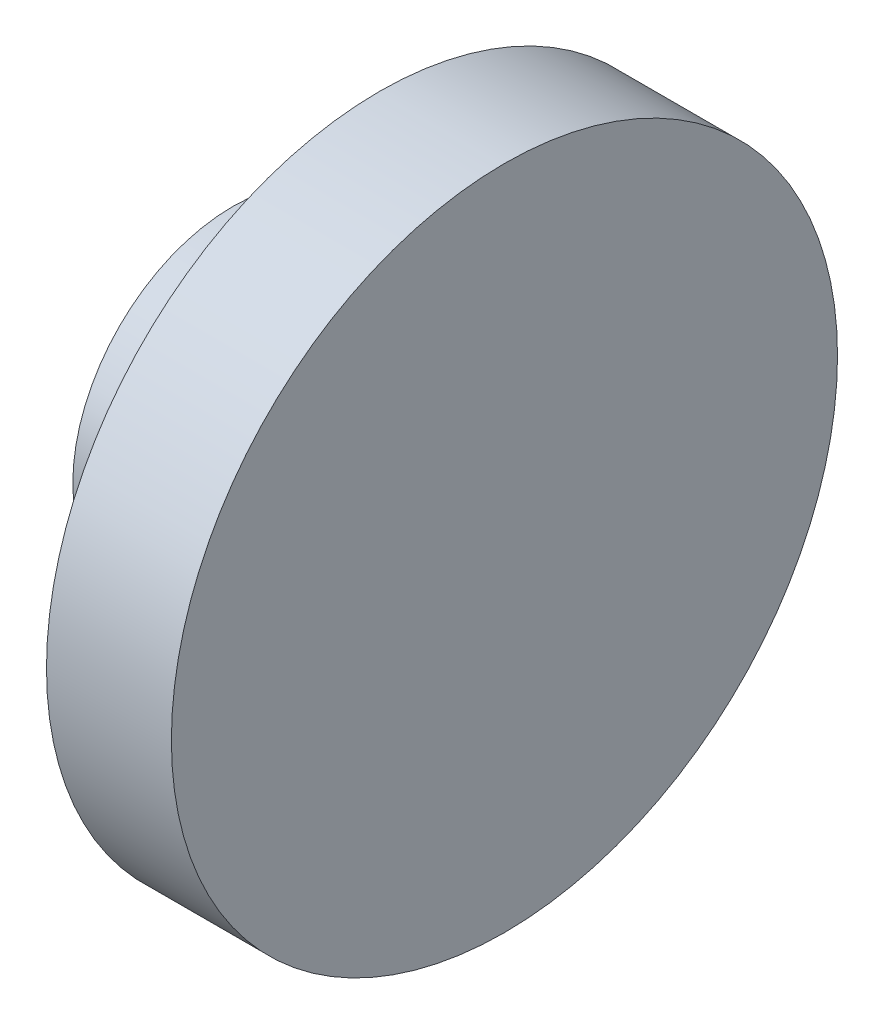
from build123d import *

# Parameters (mm, degrees)
F_3_64_0_04688_DIAMETER_HOLE1_D     = 1.190752
F_3_64_0_04688_DIAMETER_HOLE1_DEPTH = 1.6002
F_3_64_0_04688_DIAMETER_HOLE1_TIP   = 0.357737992


with BuildPart() as part:
    # Sketch1 → Revolve1 (revolve)
    with BuildSketch(Plane.XY, mode=Mode.PRIVATE) as revolve1_sk:
        Polygon((-1.2954, 1.524), (0.104775, 1.524), (0.104775, 3.175), (1.2954, 3.175), (1.2954, 0), (-1.2954, 0), align=None)
    revolve(revolve1_sk.sketch.rotate(Axis((-2.77738833, 0, 0), (1, 0, 0)), 90), axis=Axis((-2.77738833, 0, 0), (1, 0, 0)))

    # 3_64 _0.04688_ Diameter Hole1
    with Locations(Plane.ZY.offset(1.2954)):
        with Locations((0, 0)):
            Hole(F_3_64_0_04688_DIAMETER_HOLE1_D / 2, depth=F_3_64_0_04688_DIAMETER_HOLE1_DEPTH)
            with Locations((0, 0, -(F_3_64_0_04688_DIAMETER_HOLE1_DEPTH + F_3_64_0_04688_DIAMETER_HOLE1_TIP / 2))):  # 118° drill point
                Cone(0, F_3_64_0_04688_DIAMETER_HOLE1_D / 2, F_3_64_0_04688_DIAMETER_HOLE1_TIP, mode=Mode.SUBTRACT)


solid = part.part
